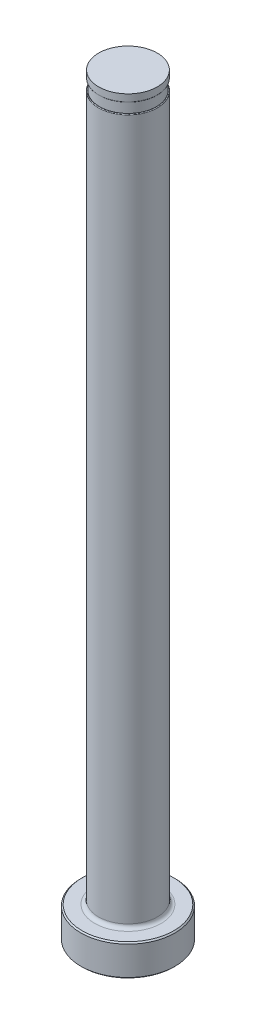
from build123d import *

# Parameters (mm, degrees)
CHAMFER1_SIZE     = 0.254
FILLET1_R         = 0.762
SKETCH2_W         = 0.2032
SKETCH2_H         = 2.032
D_SLOT_DEPTH      = 153.9941543
D_SLOT_DEPTH_BACK = 153.9941543
SKETCH5_W         = 0.0254
SKETCH5_H         = 1.524
FILLET2_R         = 0.127


with BuildPart() as part:
    # Sketch1 → Revolve1 (revolve)
    with BuildSketch(Plane.XY, mode=Mode.PRIVATE) as revolve1_sk:
        Polygon((0, 0), (-9.525, 0), (-9.525, 6.35), (-5.95249, 6.35), (-5.95249, 152.4), (0, 152.4), align=None)
    revolve(revolve1_sk.sketch.rotate(Axis((0, 259.958771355, 0), (0, -1, 0)), 270), axis=Axis((0, 259.958771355, 0), (0, -1, 0)))

    # Chamfer1
    chamfer1_edges = [part.edges().sort_by_distance(p)[0] for p in [
        (0, 6.35, -9.525),
        (0, 0, -9.525),
    ]]
    chamfer(chamfer1_edges, length=CHAMFER1_SIZE)

    # Fillet1
    fillet1_edges = [part.edges().sort_by_distance(p)[0] for p in [
        (0, 6.35, -5.95249),
    ]]
    fillet(fillet1_edges, radius=FILLET1_R)

    # Sketch2 → Vent Relief (revolve, cut)
    with BuildSketch(Plane.XY, mode=Mode.PRIVATE) as vent_relief_sk:
        with Locations((-5.85089, 149.86)):
            Rectangle(SKETCH2_W, SKETCH2_H)
    revolve(vent_relief_sk.sketch.rotate(Axis((0, 153.448281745, 0), (0, -1, 0)), 270), axis=Axis((0, 153.448281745, 0), (0, -1, 0)), mode=Mode.SUBTRACT)

    # Sketch3 → D-Slot (cut, two sides: drawn at the far end of the back side and taken through both)
    with BuildSketch(Plane.XY.offset(-D_SLOT_DEPTH_BACK)):
        with BuildLine():
            Line((-5.74929, 149.86), (-5.74929, 86.36))
            ThreePointArc((-5.74929, 86.36), (-5.800503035, 85.792038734), (-5.95249, 85.2424))
            Line((-5.95249, 85.2424), (-5.95249, 149.86))
            Line((-5.95249, 149.86), (-5.74929, 149.86))
        make_face()
    extrude(amount=D_SLOT_DEPTH + D_SLOT_DEPTH_BACK, mode=Mode.SUBTRACT)

    # Sketch5 → Vent Diameter (revolve, cut)
    with BuildSketch(Plane.XY, mode=Mode.PRIVATE) as vent_diameter_sk:
        with Locations((-5.93979, 151.638)):
            Rectangle(SKETCH5_W, SKETCH5_H)
    revolve(vent_diameter_sk.sketch.rotate(Axis((0, 152.687735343, 0), (0, -1, 0)), 90), axis=Axis((0, 152.687735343, 0), (0, -1, 0)), mode=Mode.SUBTRACT)

    # Fillet2
    fillet2_edges = [part.edges().sort_by_distance(p)[0] for p in [
        (4.722867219, 148.844, -3.623073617),
        (0, 150.876, 5.92709),
    ]]
    fillet(fillet2_edges, radius=FILLET2_R)


solid = part.part
